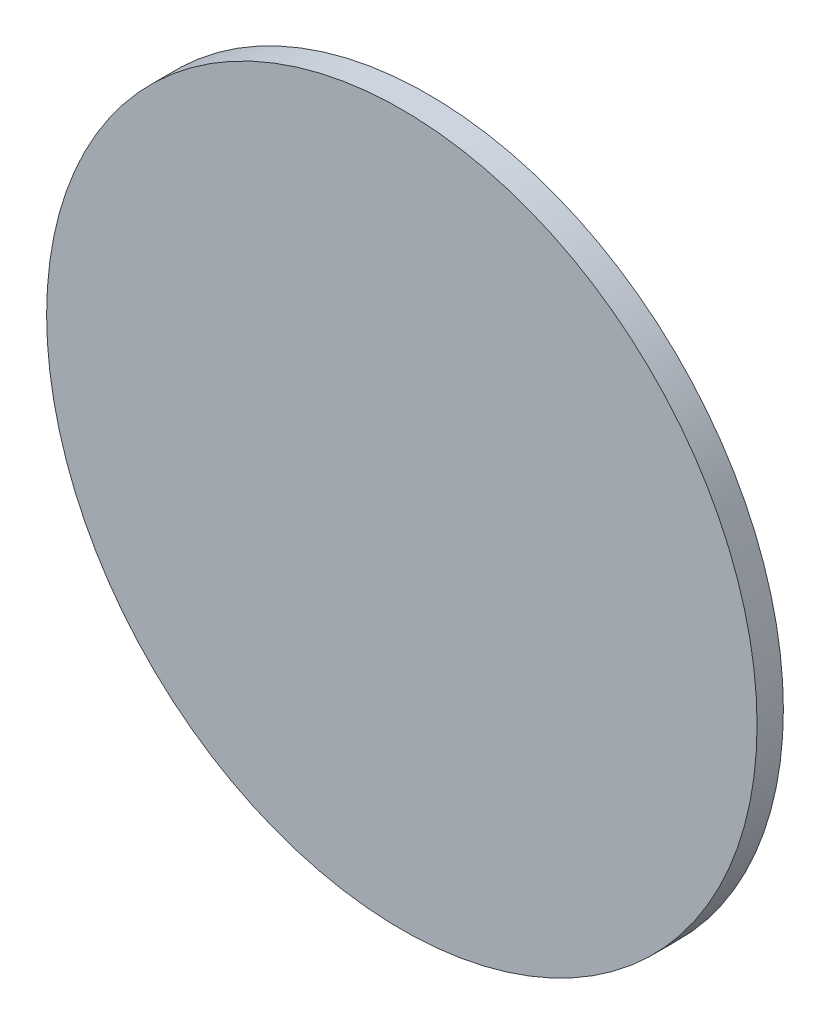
from build123d import *

# Parameters (mm, degrees)
ESQUISSE1_R      = 13.5
EXTRUSION1_DEPTH = 1


with BuildPart() as part:
    # Esquisse1 → Extrusion1 (new body)
    with BuildSketch(Plane.XY):
        Circle(ESQUISSE1_R)
    extrude(amount=EXTRUSION1_DEPTH)


solid = part.part
